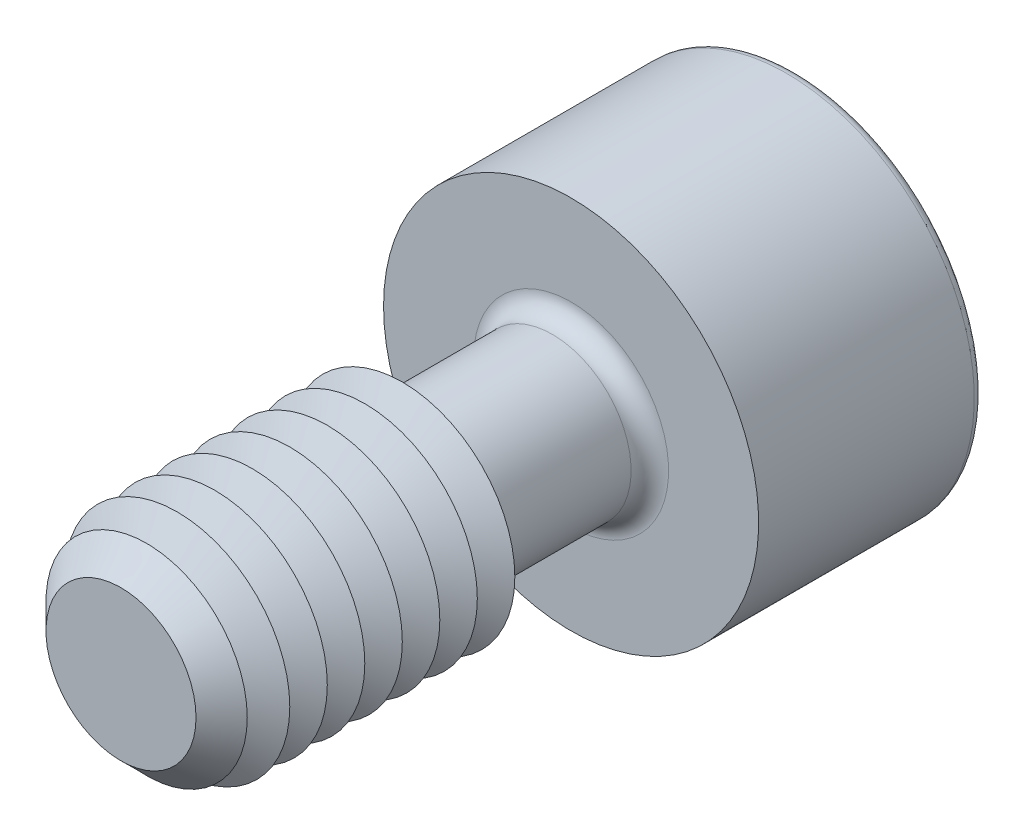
ISO-10303-21;
HEADER;
FILE_DESCRIPTION(('STEP AP214'),'2;1');
FILE_NAME('part.step','',(''),(''),'','','');
FILE_SCHEMA(('AUTOMOTIVE_DESIGN { 1 0 10303 214 1 1 1 1 }'));
ENDSEC;
DATA;
#1=APPLICATION_CONTEXT('core data for automotive mechanical design processes');
#2=APPLICATION_PROTOCOL_DEFINITION('international standard','automotive_design',2000,#1);
#3=PRODUCT_CONTEXT('',#1,'mechanical');
#4=PRODUCT('Part','Part','',(#3));
#5=PRODUCT_RELATED_PRODUCT_CATEGORY('part','',(#4));
#6=PRODUCT_DEFINITION_FORMATION('','',#4);
#7=PRODUCT_DEFINITION_CONTEXT('part definition',#1,'design');
#8=PRODUCT_DEFINITION('design','',#6,#7);
#9=PRODUCT_DEFINITION_SHAPE('','',#8);
#10=(LENGTH_UNIT() NAMED_UNIT(*) SI_UNIT(.MILLI.,.METRE.));
#11=(NAMED_UNIT(*) PLANE_ANGLE_UNIT() SI_UNIT($,.RADIAN.));
#12=(NAMED_UNIT(*) SI_UNIT($,.STERADIAN.) SOLID_ANGLE_UNIT());
#13=UNCERTAINTY_MEASURE_WITH_UNIT(LENGTH_MEASURE(1.E-05),#10,'distance_accuracy_value','');
#14=(GEOMETRIC_REPRESENTATION_CONTEXT(3) GLOBAL_UNCERTAINTY_ASSIGNED_CONTEXT((#13)) GLOBAL_UNIT_ASSIGNED_CONTEXT((#10,
#11,#12)) REPRESENTATION_CONTEXT('',''));
#15=CARTESIAN_POINT('',(0.,0.,0.));
#16=DIRECTION('',(0.,0.,1.));
#17=DIRECTION('',(1.,0.,0.));
#18=AXIS2_PLACEMENT_3D('',#15,#16,#17);
#19=CARTESIAN_POINT('',(-1.44337567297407,-2.5,-7.));
#20=DIRECTION('',(0.,0.,1.));
#21=DIRECTION('',(1.,0.,0.));
#22=AXIS2_PLACEMENT_3D('',#19,#20,#21);
#23=PLANE('',#22);
#24=DIRECTION('',(1.,0.,0.));
#25=VECTOR('',#24,1.);
#26=CARTESIAN_POINT('',(-1.44337567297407,-2.5,-7.));
#27=LINE('',#26,#25);
#28=CARTESIAN_POINT('',(0.,-2.5,-7.));
#29=VERTEX_POINT('',#28);
#30=CARTESIAN_POINT('',(1.44337567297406,-2.5,-7.));
#31=VERTEX_POINT('',#30);
#32=EDGE_CURVE('E729',#29,#31,#27,.T.);
#33=ORIENTED_EDGE('',*,*,#32,.F.);
#34=CARTESIAN_POINT('',(0.,0.,-7.));
#35=DIRECTION('',(0.,0.,1.));
#36=DIRECTION('',(0.,-1.,0.));
#37=AXIS2_PLACEMENT_3D('',#34,#35,#36);
#38=CIRCLE('',#37,2.5);
#39=CARTESIAN_POINT('',(2.1650635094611,-1.25,-7.));
#40=VERTEX_POINT('',#39);
#41=EDGE_CURVE('E53',#29,#40,#38,.T.);
#42=ORIENTED_EDGE('',*,*,#41,.T.);
#43=DIRECTION('',(0.5,0.866025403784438,0.));
#44=VECTOR('',#43,1.);
#45=CARTESIAN_POINT('',(1.44337567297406,-2.5,-7.));
#46=LINE('',#45,#44);
#47=EDGE_CURVE('E716',#31,#40,#46,.T.);
#48=ORIENTED_EDGE('',*,*,#47,.F.);
#49=EDGE_LOOP('',(#33,#42,#48));
#50=FACE_BOUND('',#49,.T.);
#51=ADVANCED_FACE('F41',(#50),#23,.F.);
#52=CARTESIAN_POINT('',(2.88675134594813,0.,-7.));
#53=VERTEX_POINT('',#52);
#54=EDGE_CURVE('E725',#40,#53,#46,.T.);
#55=ORIENTED_EDGE('',*,*,#54,.F.);
#56=CARTESIAN_POINT('',(2.1650635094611,1.25,-6.99999999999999));
#57=VERTEX_POINT('',#56);
#58=EDGE_CURVE('E11',#40,#57,#38,.T.);
#59=ORIENTED_EDGE('',*,*,#58,.T.);
#60=DIRECTION('',(-0.5,0.866025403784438,0.));
#61=VECTOR('',#60,1.);
#62=CARTESIAN_POINT('',(2.88675134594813,0.,-7.));
#63=LINE('',#62,#61);
#64=EDGE_CURVE('E715',#53,#57,#63,.T.);
#65=ORIENTED_EDGE('',*,*,#64,.F.);
#66=EDGE_LOOP('',(#55,#59,#65));
#67=FACE_BOUND('',#66,.T.);
#68=ADVANCED_FACE('F133',(#67),#23,.F.);
#69=CARTESIAN_POINT('',(1.44337567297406,2.5,-7.));
#70=VERTEX_POINT('',#69);
#71=EDGE_CURVE('E710',#57,#70,#63,.T.);
#72=ORIENTED_EDGE('',*,*,#71,.F.);
#73=CARTESIAN_POINT('',(0.,2.5,-6.99999999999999));
#74=VERTEX_POINT('',#73);
#75=EDGE_CURVE('E51',#57,#74,#38,.T.);
#76=ORIENTED_EDGE('',*,*,#75,.T.);
#77=DIRECTION('',(-1.,0.,0.));
#78=VECTOR('',#77,1.);
#79=CARTESIAN_POINT('',(1.44337567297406,2.5,-7.));
#80=LINE('',#79,#78);
#81=EDGE_CURVE('E177',#70,#74,#80,.T.);
#82=ORIENTED_EDGE('',*,*,#81,.F.);
#83=EDGE_LOOP('',(#72,#76,#82));
#84=FACE_BOUND('',#83,.T.);
#85=ADVANCED_FACE('F139',(#84),#23,.F.);
#86=CARTESIAN_POINT('',(-1.44337567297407,2.5,-7.));
#87=VERTEX_POINT('',#86);
#88=EDGE_CURVE('E720',#74,#87,#80,.T.);
#89=ORIENTED_EDGE('',*,*,#88,.F.);
#90=CARTESIAN_POINT('',(-2.1650635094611,1.25,-6.99999999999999));
#91=VERTEX_POINT('',#90);
#92=EDGE_CURVE('E263',#74,#91,#38,.T.);
#93=ORIENTED_EDGE('',*,*,#92,.T.);
#94=DIRECTION('',(-0.5,-0.866025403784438,0.));
#95=VECTOR('',#94,1.);
#96=CARTESIAN_POINT('',(-1.44337567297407,2.5,-7.));
#97=LINE('',#96,#95);
#98=EDGE_CURVE('E176',#87,#91,#97,.T.);
#99=ORIENTED_EDGE('',*,*,#98,.F.);
#100=EDGE_LOOP('',(#89,#93,#99));
#101=FACE_BOUND('',#100,.T.);
#102=ADVANCED_FACE('F157',(#101),#23,.F.);
#103=CARTESIAN_POINT('',(-2.88675134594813,0.,-7.));
#104=VERTEX_POINT('',#103);
#105=EDGE_CURVE('E170',#91,#104,#97,.T.);
#106=ORIENTED_EDGE('',*,*,#105,.F.);
#107=CARTESIAN_POINT('',(-2.1650635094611,-1.25,-7.));
#108=VERTEX_POINT('',#107);
#109=EDGE_CURVE('E172',#91,#108,#38,.T.);
#110=ORIENTED_EDGE('',*,*,#109,.T.);
#111=DIRECTION('',(0.5,-0.866025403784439,0.));
#112=VECTOR('',#111,1.);
#113=CARTESIAN_POINT('',(-2.88675134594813,0.,-7.));
#114=LINE('',#113,#112);
#115=EDGE_CURVE('E174',#104,#108,#114,.T.);
#116=ORIENTED_EDGE('',*,*,#115,.F.);
#117=EDGE_LOOP('',(#106,#110,#116));
#118=FACE_BOUND('',#117,.T.);
#119=ADVANCED_FACE('F146',(#118),#23,.F.);
#120=CARTESIAN_POINT('',(0.,0.,-12.));
#121=DIRECTION('',(0.,0.,-1.));
#122=DIRECTION('',(-1.,0.,0.));
#123=AXIS2_PLACEMENT_3D('',#120,#121,#122);
#124=PLANE('',#123);
#125=CARTESIAN_POINT('',(0.,0.,-12.));
#126=DIRECTION('',(0.,0.,-1.));
#127=DIRECTION('',(-1.,0.,0.));
#128=AXIS2_PLACEMENT_3D('',#125,#126,#127);
#129=CIRCLE('',#128,4.75);
#130=CARTESIAN_POINT('',(-4.75,0.,-12.));
#131=VERTEX_POINT('',#130);
#132=EDGE_CURVE('E251',#131,#131,#129,.T.);
#133=ORIENTED_EDGE('',*,*,#132,.T.);
#134=EDGE_LOOP('',(#133));
#135=FACE_BOUND('',#134,.T.);
#136=DIRECTION('',(-0.5,-0.866025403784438,0.));
#137=VECTOR('',#136,1.);
#138=CARTESIAN_POINT('',(-1.44337567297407,2.5,-12.));
#139=LINE('',#138,#137);
#140=CARTESIAN_POINT('',(-1.44337567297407,2.5,-12.));
#141=VERTEX_POINT('',#140);
#142=CARTESIAN_POINT('',(-2.88675134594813,0.,-12.));
#143=VERTEX_POINT('',#142);
#144=EDGE_CURVE('E212',#141,#143,#139,.T.);
#145=ORIENTED_EDGE('',*,*,#144,.T.);
#146=DIRECTION('',(0.5,-0.866025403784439,0.));
#147=VECTOR('',#146,1.);
#148=CARTESIAN_POINT('',(-2.88675134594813,0.,-12.));
#149=LINE('',#148,#147);
#150=CARTESIAN_POINT('',(-1.44337567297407,-2.5,-12.));
#151=VERTEX_POINT('',#150);
#152=EDGE_CURVE('E67',#143,#151,#149,.T.);
#153=ORIENTED_EDGE('',*,*,#152,.T.);
#154=DIRECTION('',(1.,0.,0.));
#155=VECTOR('',#154,1.);
#156=CARTESIAN_POINT('',(-1.44337567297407,-2.5,-12.));
#157=LINE('',#156,#155);
#158=CARTESIAN_POINT('',(1.44337567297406,-2.5,-12.));
#159=VERTEX_POINT('',#158);
#160=EDGE_CURVE('E196',#151,#159,#157,.T.);
#161=ORIENTED_EDGE('',*,*,#160,.T.);
#162=DIRECTION('',(0.5,0.866025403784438,0.));
#163=VECTOR('',#162,1.);
#164=CARTESIAN_POINT('',(1.44337567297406,-2.5,-12.));
#165=LINE('',#164,#163);
#166=CARTESIAN_POINT('',(2.88675134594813,0.,-12.));
#167=VERTEX_POINT('',#166);
#168=EDGE_CURVE('E200',#159,#167,#165,.T.);
#169=ORIENTED_EDGE('',*,*,#168,.T.);
#170=DIRECTION('',(-0.5,0.866025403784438,0.));
#171=VECTOR('',#170,1.);
#172=CARTESIAN_POINT('',(2.88675134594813,0.,-12.));
#173=LINE('',#172,#171);
#174=CARTESIAN_POINT('',(1.44337567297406,2.5,-12.));
#175=VERTEX_POINT('',#174);
#176=EDGE_CURVE('E204',#167,#175,#173,.T.);
#177=ORIENTED_EDGE('',*,*,#176,.T.);
#178=DIRECTION('',(-1.,0.,0.));
#179=VECTOR('',#178,1.);
#180=CARTESIAN_POINT('',(1.44337567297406,2.5,-12.));
#181=LINE('',#180,#179);
#182=EDGE_CURVE('E208',#175,#141,#181,.T.);
#183=ORIENTED_EDGE('',*,*,#182,.T.);
#184=EDGE_LOOP('',(#145,#153,#161,#169,#177,#183));
#185=FACE_BOUND('',#184,.T.);
#186=ADVANCED_FACE('F156',(#135,#185),#124,.T.);
#187=CARTESIAN_POINT('',(0.,0.,6.));
#188=DIRECTION('',(0.,0.,-1.));
#189=DIRECTION('',(-1.,0.,0.));
#190=AXIS2_PLACEMENT_3D('',#187,#188,#189);
#191=CYLINDRICAL_SURFACE('',#190,2.1);
#192=CARTESIAN_POINT('',(0.,0.,-5.5));
#193=DIRECTION('',(0.,0.,-1.));
#194=DIRECTION('',(-1.,0.,0.));
#195=AXIS2_PLACEMENT_3D('',#192,#193,#194);
#196=CIRCLE('',#195,2.1);
#197=CARTESIAN_POINT('',(-2.1,0.,-5.5));
#198=VERTEX_POINT('',#197);
#199=EDGE_CURVE('E247',#198,#198,#196,.F.);
#200=ORIENTED_EDGE('',*,*,#199,.T.);
#201=EDGE_LOOP('',(#200));
#202=FACE_BOUND('',#201,.T.);
#203=CARTESIAN_POINT('',(0.,0.,-2.01961524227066));
#204=DIRECTION('',(0.,0.,-1.));
#205=DIRECTION('',(0.,1.,0.));
#206=AXIS2_PLACEMENT_3D('',#203,#204,#205);
#207=CIRCLE('',#206,2.1);
#208=CARTESIAN_POINT('',(0.,2.1,-2.01961524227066));
#209=VERTEX_POINT('',#208);
#210=EDGE_CURVE('E235',#209,#209,#207,.T.);
#211=ORIENTED_EDGE('',*,*,#210,.T.);
#212=EDGE_LOOP('',(#211));
#213=FACE_BOUND('',#212,.T.);
#214=ADVANCED_FACE('F163',(#202,#213),#191,.T.);
#215=CARTESIAN_POINT('',(0.,0.,-2.01961524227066));
#216=DIRECTION('',(0.,0.,1.));
#217=DIRECTION('',(0.,-1.,0.));
#218=AXIS2_PLACEMENT_3D('',#215,#216,#217);
#219=CONICAL_SURFACE('',#218,2.1,1.0471975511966);
#220=CARTESIAN_POINT('',(0.,0.,-1.5));
#221=DIRECTION('',(0.,0.,-1.));
#222=DIRECTION('',(-1.,0.,0.));
#223=AXIS2_PLACEMENT_3D('',#220,#221,#222);
#224=CIRCLE('',#223,3.);
#225=CARTESIAN_POINT('',(-3.,0.,-1.5));
#226=VERTEX_POINT('',#225);
#227=EDGE_CURVE('E267',#226,#226,#224,.T.);
#228=ORIENTED_EDGE('',*,*,#227,.T.);
#229=EDGE_LOOP('',(#228));
#230=FACE_BOUND('',#229,.T.);
#231=ORIENTED_EDGE('',*,*,#210,.F.);
#232=EDGE_LOOP('',(#231));
#233=FACE_BOUND('',#232,.T.);
#234=ADVANCED_FACE('F487',(#230,#233),#219,.T.);
#235=CARTESIAN_POINT('',(0.,0.,-6.));
#236=DIRECTION('',(0.,0.,-1.));
#237=DIRECTION('',(-1.,0.,0.));
#238=AXIS2_PLACEMENT_3D('',#235,#236,#237);
#239=PLANE('',#238);
#240=CARTESIAN_POINT('',(0.,0.,-6.));
#241=DIRECTION('',(0.,0.,-1.));
#242=DIRECTION('',(-1.,0.,0.));
#243=AXIS2_PLACEMENT_3D('',#240,#241,#242);
#244=CIRCLE('',#243,2.6);
#245=CARTESIAN_POINT('',(-2.6,0.,-6.));
#246=VERTEX_POINT('',#245);
#247=EDGE_CURVE('E243',#246,#246,#244,.T.);
#248=ORIENTED_EDGE('',*,*,#247,.T.);
#249=EDGE_LOOP('',(#248));
#250=FACE_BOUND('',#249,.T.);
#251=CARTESIAN_POINT('',(0.,0.,-6.));
#252=DIRECTION('',(0.,0.,-1.));
#253=DIRECTION('',(-1.,0.,0.));
#254=AXIS2_PLACEMENT_3D('',#251,#252,#253);
#255=CIRCLE('',#254,5.);
#256=CARTESIAN_POINT('',(-5.,0.,-6.));
#257=VERTEX_POINT('',#256);
#258=EDGE_CURVE('E231',#257,#257,#255,.T.);
#259=ORIENTED_EDGE('',*,*,#258,.F.);
#260=EDGE_LOOP('',(#259));
#261=FACE_BOUND('',#260,.T.);
#262=ADVANCED_FACE('F480',(#250,#261),#239,.F.);
#263=CARTESIAN_POINT('',(0.,0.,-12.));
#264=DIRECTION('',(0.,0.,1.));
#265=DIRECTION('',(1.,0.,0.));
#266=AXIS2_PLACEMENT_3D('',#263,#264,#265);
#267=CYLINDRICAL_SURFACE('',#266,5.);
#268=CARTESIAN_POINT('',(0.,0.,-11.75));
#269=DIRECTION('',(0.,0.,-1.));
#270=DIRECTION('',(-1.,0.,0.));
#271=AXIS2_PLACEMENT_3D('',#268,#269,#270);
#272=CIRCLE('',#271,5.);
#273=CARTESIAN_POINT('',(-5.,0.,-11.75));
#274=VERTEX_POINT('',#273);
#275=EDGE_CURVE('E254',#274,#274,#272,.F.);
#276=ORIENTED_EDGE('',*,*,#275,.T.);
#277=EDGE_LOOP('',(#276));
#278=FACE_BOUND('',#277,.T.);
#279=ORIENTED_EDGE('',*,*,#258,.T.);
#280=EDGE_LOOP('',(#279));
#281=FACE_BOUND('',#280,.T.);
#282=ADVANCED_FACE('F486',(#278,#281),#267,.T.);
#283=CARTESIAN_POINT('',(-2.88675134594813,0.,-7.));
#284=DIRECTION('',(0.866025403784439,0.5,0.));
#285=DIRECTION('',(-0.5,0.866025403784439,0.));
#286=AXIS2_PLACEMENT_3D('',#283,#284,#285);
#287=PLANE('',#286);
#288=ORIENTED_EDGE('',*,*,#152,.F.);
#289=DIRECTION('',(0.,0.,-1.));
#290=VECTOR('',#289,1.);
#291=CARTESIAN_POINT('',(-2.88675134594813,0.,-7.));
#292=LINE('',#291,#290);
#293=EDGE_CURVE('E186',#104,#143,#292,.T.);
#294=ORIENTED_EDGE('',*,*,#293,.F.);
#295=ORIENTED_EDGE('',*,*,#115,.T.);
#296=CARTESIAN_POINT('',(-1.44337567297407,-2.5,-7.));
#297=VERTEX_POINT('',#296);
#298=EDGE_CURVE('E215',#108,#297,#114,.T.);
#299=ORIENTED_EDGE('',*,*,#298,.T.);
#300=DIRECTION('',(0.,0.,-1.));
#301=VECTOR('',#300,1.);
#302=CARTESIAN_POINT('',(-1.44337567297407,-2.5,-7.));
#303=LINE('',#302,#301);
#304=EDGE_CURVE('E228',#297,#151,#303,.T.);
#305=ORIENTED_EDGE('',*,*,#304,.T.);
#306=EDGE_LOOP('',(#288,#294,#295,#299,#305));
#307=FACE_BOUND('',#306,.T.);
#308=ADVANCED_FACE('F498',(#307),#287,.T.);
#309=CARTESIAN_POINT('',(-1.44337567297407,-2.5,-7.));
#310=DIRECTION('',(0.,1.,0.));
#311=DIRECTION('',(-1.,0.,0.));
#312=AXIS2_PLACEMENT_3D('',#309,#310,#311);
#313=PLANE('',#312);
#314=ORIENTED_EDGE('',*,*,#160,.F.);
#315=ORIENTED_EDGE('',*,*,#304,.F.);
#316=EDGE_CURVE('E726',#297,#29,#27,.T.);
#317=ORIENTED_EDGE('',*,*,#316,.T.);
#318=ORIENTED_EDGE('',*,*,#32,.T.);
#319=DIRECTION('',(0.,0.,-1.));
#320=VECTOR('',#319,1.);
#321=CARTESIAN_POINT('',(1.44337567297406,-2.5,-7.));
#322=LINE('',#321,#320);
#323=EDGE_CURVE('E225',#31,#159,#322,.T.);
#324=ORIENTED_EDGE('',*,*,#323,.T.);
#325=EDGE_LOOP('',(#314,#315,#317,#318,#324));
#326=FACE_BOUND('',#325,.T.);
#327=ADVANCED_FACE('F514',(#326),#313,.T.);
#328=CARTESIAN_POINT('',(1.44337567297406,-2.5,-7.));
#329=DIRECTION('',(-0.866025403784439,0.5,0.));
#330=DIRECTION('',(-0.5,-0.866025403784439,0.));
#331=AXIS2_PLACEMENT_3D('',#328,#329,#330);
#332=PLANE('',#331);
#333=ORIENTED_EDGE('',*,*,#168,.F.);
#334=ORIENTED_EDGE('',*,*,#323,.F.);
#335=ORIENTED_EDGE('',*,*,#47,.T.);
#336=ORIENTED_EDGE('',*,*,#54,.T.);
#337=DIRECTION('',(0.,0.,-1.));
#338=VECTOR('',#337,1.);
#339=CARTESIAN_POINT('',(2.88675134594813,0.,-7.));
#340=LINE('',#339,#338);
#341=EDGE_CURVE('E222',#53,#167,#340,.T.);
#342=ORIENTED_EDGE('',*,*,#341,.T.);
#343=EDGE_LOOP('',(#333,#334,#335,#336,#342));
#344=FACE_BOUND('',#343,.T.);
#345=ADVANCED_FACE('F524',(#344),#332,.T.);
#346=CARTESIAN_POINT('',(2.88675134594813,0.,-7.));
#347=DIRECTION('',(-0.866025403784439,-0.5,0.));
#348=DIRECTION('',(0.5,-0.866025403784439,0.));
#349=AXIS2_PLACEMENT_3D('',#346,#347,#348);
#350=PLANE('',#349);
#351=ORIENTED_EDGE('',*,*,#176,.F.);
#352=ORIENTED_EDGE('',*,*,#341,.F.);
#353=ORIENTED_EDGE('',*,*,#64,.T.);
#354=ORIENTED_EDGE('',*,*,#71,.T.);
#355=DIRECTION('',(0.,0.,-1.));
#356=VECTOR('',#355,1.);
#357=CARTESIAN_POINT('',(1.44337567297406,2.5,-7.));
#358=LINE('',#357,#356);
#359=EDGE_CURVE('E219',#70,#175,#358,.T.);
#360=ORIENTED_EDGE('',*,*,#359,.T.);
#361=EDGE_LOOP('',(#351,#352,#353,#354,#360));
#362=FACE_BOUND('',#361,.T.);
#363=ADVANCED_FACE('F534',(#362),#350,.T.);
#364=CARTESIAN_POINT('',(1.44337567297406,2.5,-7.));
#365=DIRECTION('',(0.,-1.,0.));
#366=DIRECTION('',(0.,0.,-1.));
#367=AXIS2_PLACEMENT_3D('',#364,#365,#366);
#368=PLANE('',#367);
#369=ORIENTED_EDGE('',*,*,#182,.F.);
#370=ORIENTED_EDGE('',*,*,#359,.F.);
#371=ORIENTED_EDGE('',*,*,#81,.T.);
#372=ORIENTED_EDGE('',*,*,#88,.T.);
#373=DIRECTION('',(0.,0.,-1.));
#374=VECTOR('',#373,1.);
#375=CARTESIAN_POINT('',(-1.44337567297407,2.5,-7.));
#376=LINE('',#375,#374);
#377=EDGE_CURVE('E182',#87,#141,#376,.T.);
#378=ORIENTED_EDGE('',*,*,#377,.T.);
#379=EDGE_LOOP('',(#369,#370,#371,#372,#378));
#380=FACE_BOUND('',#379,.T.);
#381=ADVANCED_FACE('F152',(#380),#368,.T.);
#382=CARTESIAN_POINT('',(-1.44337567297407,2.5,-7.));
#383=DIRECTION('',(0.866025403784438,-0.5,0.));
#384=DIRECTION('',(0.5,0.866025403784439,0.));
#385=AXIS2_PLACEMENT_3D('',#382,#383,#384);
#386=PLANE('',#385);
#387=ORIENTED_EDGE('',*,*,#144,.F.);
#388=ORIENTED_EDGE('',*,*,#377,.F.);
#389=ORIENTED_EDGE('',*,*,#98,.T.);
#390=ORIENTED_EDGE('',*,*,#105,.T.);
#391=ORIENTED_EDGE('',*,*,#293,.T.);
#392=EDGE_LOOP('',(#387,#388,#389,#390,#391));
#393=FACE_BOUND('',#392,.T.);
#394=ADVANCED_FACE('F144',(#393),#386,.T.);
#395=ORIENTED_EDGE('',*,*,#298,.F.);
#396=EDGE_CURVE('E257',#108,#29,#38,.T.);
#397=ORIENTED_EDGE('',*,*,#396,.T.);
#398=ORIENTED_EDGE('',*,*,#316,.F.);
#399=EDGE_LOOP('',(#395,#397,#398));
#400=FACE_BOUND('',#399,.T.);
#401=ADVANCED_FACE('F135',(#400),#23,.F.);
#402=CARTESIAN_POINT('',(0.,0.,-5.5));
#403=DIRECTION('',(0.,0.,-1.));
#404=DIRECTION('',(-1.,0.,0.));
#405=AXIS2_PLACEMENT_3D('',#402,#403,#404);
#406=TOROIDAL_SURFACE('',#405,2.6,0.5);
#407=ORIENTED_EDGE('',*,*,#199,.F.);
#408=EDGE_LOOP('',(#407));
#409=FACE_BOUND('',#408,.T.);
#410=ORIENTED_EDGE('',*,*,#247,.F.);
#411=EDGE_LOOP('',(#410));
#412=FACE_BOUND('',#411,.T.);
#413=ADVANCED_FACE('F129',(#409,#412),#406,.F.);
#414=CARTESIAN_POINT('',(0.,0.,-11.75));
#415=DIRECTION('',(0.,0.,-1.));
#416=DIRECTION('',(-1.,0.,0.));
#417=AXIS2_PLACEMENT_3D('',#414,#415,#416);
#418=TOROIDAL_SURFACE('',#417,4.75,0.25);
#419=ORIENTED_EDGE('',*,*,#275,.F.);
#420=EDGE_LOOP('',(#419));
#421=FACE_BOUND('',#420,.T.);
#422=ORIENTED_EDGE('',*,*,#132,.F.);
#423=EDGE_LOOP('',(#422));
#424=FACE_BOUND('',#423,.T.);
#425=ADVANCED_FACE('F43',(#421,#424),#418,.T.);
#426=CARTESIAN_POINT('',(0.,0.,-5.55662432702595));
#427=DIRECTION('',(0.,0.,-1.));
#428=DIRECTION('',(0.,1.,0.));
#429=AXIS2_PLACEMENT_3D('',#426,#427,#428);
#430=CONICAL_SURFACE('',#429,0.,1.0471975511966);
#431=ORIENTED_EDGE('',*,*,#41,.F.);
#432=ORIENTED_EDGE('',*,*,#396,.F.);
#433=ORIENTED_EDGE('',*,*,#109,.F.);
#434=ORIENTED_EDGE('',*,*,#92,.F.);
#435=ORIENTED_EDGE('',*,*,#75,.F.);
#436=ORIENTED_EDGE('',*,*,#58,.F.);
#437=EDGE_LOOP('',(#431,#432,#433,#434,#435,#436));
#438=FACE_BOUND('',#437,.T.);
#439=CARTESIAN_POINT('',(0.,0.,-5.55662432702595));
#440=VERTEX_POINT('',#439);
#441=VERTEX_LOOP('',#440);
#442=FACE_BOUND('',#441,.T.);
#443=ADVANCED_FACE('F118',(#438,#442),#430,.F.);
#444=CARTESIAN_POINT('',(0.,0.,-1.));
#445=DIRECTION('',(0.,0.,-1.));
#446=DIRECTION('',(-1.,0.,0.));
#447=AXIS2_PLACEMENT_3D('',#444,#445,#446);
#448=CONICAL_SURFACE('',#447,2.13397459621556,1.0471975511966);
#449=ORIENTED_EDGE('',*,*,#227,.F.);
#450=EDGE_LOOP('',(#449));
#451=FACE_BOUND('',#450,.T.);
#452=CARTESIAN_POINT('',(0.,0.,-1.));
#453=DIRECTION('',(0.,0.,-1.));
#454=DIRECTION('',(-1.,0.,0.));
#455=AXIS2_PLACEMENT_3D('',#452,#453,#454);
#456=CIRCLE('',#455,2.13397459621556);
#457=CARTESIAN_POINT('',(-2.13397459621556,0.,-1.));
#458=VERTEX_POINT('',#457);
#459=EDGE_CURVE('E273',#458,#458,#456,.T.);
#460=ORIENTED_EDGE('',*,*,#459,.T.);
#461=EDGE_LOOP('',(#460));
#462=FACE_BOUND('',#461,.T.);
#463=ADVANCED_FACE('F120',(#451,#462),#448,.T.);
#464=CARTESIAN_POINT('',(0.,0.,-0.5));
#465=DIRECTION('',(0.,0.,1.));
#466=DIRECTION('',(1.,0.,0.));
#467=AXIS2_PLACEMENT_3D('',#464,#465,#466);
#468=CONICAL_SURFACE('',#467,3.,1.0471975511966);
#469=ORIENTED_EDGE('',*,*,#459,.F.);
#470=EDGE_LOOP('',(#469));
#471=FACE_BOUND('',#470,.T.);
#472=CARTESIAN_POINT('',(0.,0.,-0.500000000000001));
#473=DIRECTION('',(0.,0.,-1.));
#474=DIRECTION('',(-1.,0.,0.));
#475=AXIS2_PLACEMENT_3D('',#472,#473,#474);
#476=CIRCLE('',#475,3.);
#477=CARTESIAN_POINT('',(-3.,0.,-0.500000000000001));
#478=VERTEX_POINT('',#477);
#479=EDGE_CURVE('E279',#478,#478,#476,.T.);
#480=ORIENTED_EDGE('',*,*,#479,.T.);
#481=EDGE_LOOP('',(#480));
#482=FACE_BOUND('',#481,.T.);
#483=ADVANCED_FACE('F126',(#471,#482),#468,.T.);
#484=CARTESIAN_POINT('',(0.,0.,0.));
#485=DIRECTION('',(0.,0.,-1.));
#486=DIRECTION('',(-1.,0.,0.));
#487=AXIS2_PLACEMENT_3D('',#484,#485,#486);
#488=CONICAL_SURFACE('',#487,2.13397459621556,1.0471975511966);
#489=ORIENTED_EDGE('',*,*,#479,.F.);
#490=EDGE_LOOP('',(#489));
#491=FACE_BOUND('',#490,.T.);
#492=CARTESIAN_POINT('',(0.,0.,0.));
#493=DIRECTION('',(0.,0.,-1.));
#494=DIRECTION('',(-1.,0.,0.));
#495=AXIS2_PLACEMENT_3D('',#492,#493,#494);
#496=CIRCLE('',#495,2.13397459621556);
#497=CARTESIAN_POINT('',(-2.13397459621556,0.,0.));
#498=VERTEX_POINT('',#497);
#499=EDGE_CURVE('E285',#498,#498,#496,.T.);
#500=ORIENTED_EDGE('',*,*,#499,.T.);
#501=EDGE_LOOP('',(#500));
#502=FACE_BOUND('',#501,.T.);
#503=ADVANCED_FACE('F384',(#491,#502),#488,.T.);
#504=CARTESIAN_POINT('',(0.,0.,0.5));
#505=DIRECTION('',(0.,0.,1.));
#506=DIRECTION('',(1.,0.,0.));
#507=AXIS2_PLACEMENT_3D('',#504,#505,#506);
#508=CONICAL_SURFACE('',#507,3.,1.0471975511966);
#509=ORIENTED_EDGE('',*,*,#499,.F.);
#510=EDGE_LOOP('',(#509));
#511=FACE_BOUND('',#510,.T.);
#512=CARTESIAN_POINT('',(0.,0.,0.499999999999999));
#513=DIRECTION('',(0.,0.,-1.));
#514=DIRECTION('',(-1.,0.,0.));
#515=AXIS2_PLACEMENT_3D('',#512,#513,#514);
#516=CIRCLE('',#515,3.);
#517=CARTESIAN_POINT('',(-3.,0.,0.499999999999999));
#518=VERTEX_POINT('',#517);
#519=EDGE_CURVE('E289',#518,#518,#516,.T.);
#520=ORIENTED_EDGE('',*,*,#519,.T.);
#521=EDGE_LOOP('',(#520));
#522=FACE_BOUND('',#521,.T.);
#523=ADVANCED_FACE('F380',(#511,#522),#508,.T.);
#524=CARTESIAN_POINT('',(0.,0.,0.999999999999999));
#525=DIRECTION('',(0.,0.,-1.));
#526=DIRECTION('',(-1.,0.,0.));
#527=AXIS2_PLACEMENT_3D('',#524,#525,#526);
#528=CONICAL_SURFACE('',#527,2.13397459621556,1.0471975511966);
#529=ORIENTED_EDGE('',*,*,#519,.F.);
#530=EDGE_LOOP('',(#529));
#531=FACE_BOUND('',#530,.T.);
#532=CARTESIAN_POINT('',(0.,0.,0.999999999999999));
#533=DIRECTION('',(0.,0.,-1.));
#534=DIRECTION('',(-1.,0.,0.));
#535=AXIS2_PLACEMENT_3D('',#532,#533,#534);
#536=CIRCLE('',#535,2.13397459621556);
#537=CARTESIAN_POINT('',(-2.13397459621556,0.,0.999999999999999));
#538=VERTEX_POINT('',#537);
#539=EDGE_CURVE('E293',#538,#538,#536,.T.);
#540=ORIENTED_EDGE('',*,*,#539,.T.);
#541=EDGE_LOOP('',(#540));
#542=FACE_BOUND('',#541,.T.);
#543=ADVANCED_FACE('F376',(#531,#542),#528,.T.);
#544=CARTESIAN_POINT('',(0.,0.,1.5));
#545=DIRECTION('',(0.,0.,1.));
#546=DIRECTION('',(1.,0.,0.));
#547=AXIS2_PLACEMENT_3D('',#544,#545,#546);
#548=CONICAL_SURFACE('',#547,3.,1.0471975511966);
#549=ORIENTED_EDGE('',*,*,#539,.F.);
#550=EDGE_LOOP('',(#549));
#551=FACE_BOUND('',#550,.T.);
#552=CARTESIAN_POINT('',(0.,0.,1.5));
#553=DIRECTION('',(0.,0.,-1.));
#554=DIRECTION('',(-1.,0.,0.));
#555=AXIS2_PLACEMENT_3D('',#552,#553,#554);
#556=CIRCLE('',#555,3.);
#557=CARTESIAN_POINT('',(-3.,0.,1.5));
#558=VERTEX_POINT('',#557);
#559=EDGE_CURVE('E297',#558,#558,#556,.T.);
#560=ORIENTED_EDGE('',*,*,#559,.T.);
#561=EDGE_LOOP('',(#560));
#562=FACE_BOUND('',#561,.T.);
#563=ADVANCED_FACE('F372',(#551,#562),#548,.T.);
#564=CARTESIAN_POINT('',(0.,0.,2.));
#565=DIRECTION('',(0.,0.,-1.));
#566=DIRECTION('',(-1.,0.,0.));
#567=AXIS2_PLACEMENT_3D('',#564,#565,#566);
#568=CONICAL_SURFACE('',#567,2.13397459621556,1.0471975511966);
#569=ORIENTED_EDGE('',*,*,#559,.F.);
#570=EDGE_LOOP('',(#569));
#571=FACE_BOUND('',#570,.T.);
#572=CARTESIAN_POINT('',(0.,0.,2.));
#573=DIRECTION('',(0.,0.,-1.));
#574=DIRECTION('',(-1.,0.,0.));
#575=AXIS2_PLACEMENT_3D('',#572,#573,#574);
#576=CIRCLE('',#575,2.13397459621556);
#577=CARTESIAN_POINT('',(-2.13397459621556,0.,2.));
#578=VERTEX_POINT('',#577);
#579=EDGE_CURVE('E301',#578,#578,#576,.T.);
#580=ORIENTED_EDGE('',*,*,#579,.T.);
#581=EDGE_LOOP('',(#580));
#582=FACE_BOUND('',#581,.T.);
#583=ADVANCED_FACE('F368',(#571,#582),#568,.T.);
#584=CARTESIAN_POINT('',(0.,0.,2.5));
#585=DIRECTION('',(0.,0.,1.));
#586=DIRECTION('',(1.,0.,0.));
#587=AXIS2_PLACEMENT_3D('',#584,#585,#586);
#588=CONICAL_SURFACE('',#587,3.,1.0471975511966);
#589=ORIENTED_EDGE('',*,*,#579,.F.);
#590=EDGE_LOOP('',(#589));
#591=FACE_BOUND('',#590,.T.);
#592=CARTESIAN_POINT('',(0.,0.,2.5));
#593=DIRECTION('',(0.,0.,-1.));
#594=DIRECTION('',(-1.,0.,0.));
#595=AXIS2_PLACEMENT_3D('',#592,#593,#594);
#596=CIRCLE('',#595,3.);
#597=CARTESIAN_POINT('',(-3.,0.,2.5));
#598=VERTEX_POINT('',#597);
#599=EDGE_CURVE('E305',#598,#598,#596,.T.);
#600=ORIENTED_EDGE('',*,*,#599,.T.);
#601=EDGE_LOOP('',(#600));
#602=FACE_BOUND('',#601,.T.);
#603=ADVANCED_FACE('F364',(#591,#602),#588,.T.);
#604=CARTESIAN_POINT('',(0.,0.,3.));
#605=DIRECTION('',(0.,0.,-1.));
#606=DIRECTION('',(-1.,0.,0.));
#607=AXIS2_PLACEMENT_3D('',#604,#605,#606);
#608=CONICAL_SURFACE('',#607,2.13397459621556,1.0471975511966);
#609=ORIENTED_EDGE('',*,*,#599,.F.);
#610=EDGE_LOOP('',(#609));
#611=FACE_BOUND('',#610,.T.);
#612=CARTESIAN_POINT('',(0.,0.,3.));
#613=DIRECTION('',(0.,0.,-1.));
#614=DIRECTION('',(-1.,0.,0.));
#615=AXIS2_PLACEMENT_3D('',#612,#613,#614);
#616=CIRCLE('',#615,2.13397459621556);
#617=CARTESIAN_POINT('',(-2.13397459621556,0.,3.));
#618=VERTEX_POINT('',#617);
#619=EDGE_CURVE('E309',#618,#618,#616,.T.);
#620=ORIENTED_EDGE('',*,*,#619,.T.);
#621=EDGE_LOOP('',(#620));
#622=FACE_BOUND('',#621,.T.);
#623=ADVANCED_FACE('F360',(#611,#622),#608,.T.);
#624=CARTESIAN_POINT('',(0.,0.,3.5));
#625=DIRECTION('',(0.,0.,1.));
#626=DIRECTION('',(1.,0.,0.));
#627=AXIS2_PLACEMENT_3D('',#624,#625,#626);
#628=CONICAL_SURFACE('',#627,3.,1.0471975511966);
#629=ORIENTED_EDGE('',*,*,#619,.F.);
#630=EDGE_LOOP('',(#629));
#631=FACE_BOUND('',#630,.T.);
#632=CARTESIAN_POINT('',(0.,0.,3.5));
#633=DIRECTION('',(0.,0.,-1.));
#634=DIRECTION('',(-1.,0.,0.));
#635=AXIS2_PLACEMENT_3D('',#632,#633,#634);
#636=CIRCLE('',#635,3.);
#637=CARTESIAN_POINT('',(-3.,0.,3.5));
#638=VERTEX_POINT('',#637);
#639=EDGE_CURVE('E313',#638,#638,#636,.T.);
#640=ORIENTED_EDGE('',*,*,#639,.T.);
#641=EDGE_LOOP('',(#640));
#642=FACE_BOUND('',#641,.T.);
#643=ADVANCED_FACE('F356',(#631,#642),#628,.T.);
#644=CARTESIAN_POINT('',(0.,0.,4.));
#645=DIRECTION('',(0.,0.,-1.));
#646=DIRECTION('',(-1.,0.,0.));
#647=AXIS2_PLACEMENT_3D('',#644,#645,#646);
#648=CONICAL_SURFACE('',#647,2.13397459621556,1.0471975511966);
#649=ORIENTED_EDGE('',*,*,#639,.F.);
#650=EDGE_LOOP('',(#649));
#651=FACE_BOUND('',#650,.T.);
#652=CARTESIAN_POINT('',(0.,0.,4.));
#653=DIRECTION('',(0.,0.,-1.));
#654=DIRECTION('',(-1.,0.,0.));
#655=AXIS2_PLACEMENT_3D('',#652,#653,#654);
#656=CIRCLE('',#655,2.13397459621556);
#657=CARTESIAN_POINT('',(-2.13397459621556,0.,4.));
#658=VERTEX_POINT('',#657);
#659=EDGE_CURVE('E317',#658,#658,#656,.T.);
#660=ORIENTED_EDGE('',*,*,#659,.T.);
#661=EDGE_LOOP('',(#660));
#662=FACE_BOUND('',#661,.T.);
#663=ADVANCED_FACE('F352',(#651,#662),#648,.T.);
#664=CARTESIAN_POINT('',(0.,0.,4.5));
#665=DIRECTION('',(0.,0.,1.));
#666=DIRECTION('',(1.,0.,0.));
#667=AXIS2_PLACEMENT_3D('',#664,#665,#666);
#668=CONICAL_SURFACE('',#667,3.,1.0471975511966);
#669=ORIENTED_EDGE('',*,*,#659,.F.);
#670=EDGE_LOOP('',(#669));
#671=FACE_BOUND('',#670,.T.);
#672=CARTESIAN_POINT('',(0.,0.,4.5));
#673=DIRECTION('',(0.,0.,-1.));
#674=DIRECTION('',(-1.,0.,0.));
#675=AXIS2_PLACEMENT_3D('',#672,#673,#674);
#676=CIRCLE('',#675,3.);
#677=CARTESIAN_POINT('',(-3.,0.,4.5));
#678=VERTEX_POINT('',#677);
#679=EDGE_CURVE('E321',#678,#678,#676,.T.);
#680=ORIENTED_EDGE('',*,*,#679,.T.);
#681=EDGE_LOOP('',(#680));
#682=FACE_BOUND('',#681,.T.);
#683=ADVANCED_FACE('F345',(#671,#682),#668,.T.);
#684=CARTESIAN_POINT('',(0.,0.,5.));
#685=DIRECTION('',(0.,0.,-1.));
#686=DIRECTION('',(-1.,0.,0.));
#687=AXIS2_PLACEMENT_3D('',#684,#685,#686);
#688=CONICAL_SURFACE('',#687,2.13397459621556,1.0471975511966);
#689=ORIENTED_EDGE('',*,*,#679,.F.);
#690=EDGE_LOOP('',(#689));
#691=FACE_BOUND('',#690,.T.);
#692=CARTESIAN_POINT('',(0.,0.,5.));
#693=DIRECTION('',(0.,0.,-1.));
#694=DIRECTION('',(-1.,0.,0.));
#695=AXIS2_PLACEMENT_3D('',#692,#693,#694);
#696=CIRCLE('',#695,2.13397459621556);
#697=CARTESIAN_POINT('',(-2.13397459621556,0.,5.));
#698=VERTEX_POINT('',#697);
#699=EDGE_CURVE('E325',#698,#698,#696,.T.);
#700=ORIENTED_EDGE('',*,*,#699,.T.);
#701=EDGE_LOOP('',(#700));
#702=FACE_BOUND('',#701,.T.);
#703=ADVANCED_FACE('F331',(#691,#702),#688,.T.);
#704=CARTESIAN_POINT('',(0.,0.,5.5));
#705=DIRECTION('',(0.,0.,1.));
#706=DIRECTION('',(1.,0.,0.));
#707=AXIS2_PLACEMENT_3D('',#704,#705,#706);
#708=CONICAL_SURFACE('',#707,3.,1.0471975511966);
#709=CARTESIAN_POINT('',(0.,0.,5.31698729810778));
#710=DIRECTION('',(0.,0.,1.));
#711=DIRECTION('',(1.,0.,0.));
#712=AXIS2_PLACEMENT_3D('',#709,#710,#711);
#713=CIRCLE('',#712,2.68301270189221);
#714=CARTESIAN_POINT('',(2.68301270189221,0.,5.31698729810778));
#715=VERTEX_POINT('',#714);
#716=EDGE_CURVE('E45',#715,#715,#713,.F.);
#717=ORIENTED_EDGE('',*,*,#716,.T.);
#718=EDGE_LOOP('',(#717));
#719=FACE_BOUND('',#718,.T.);
#720=ORIENTED_EDGE('',*,*,#699,.F.);
#721=EDGE_LOOP('',(#720));
#722=FACE_BOUND('',#721,.T.);
#723=ADVANCED_FACE('F333',(#719,#722),#708,.T.);
#724=CARTESIAN_POINT('',(0.,0.,6.));
#725=DIRECTION('',(0.,0.,1.));
#726=DIRECTION('',(1.,0.,0.));
#727=AXIS2_PLACEMENT_3D('',#724,#725,#726);
#728=PLANE('',#727);
#729=CARTESIAN_POINT('',(0.,0.,6.));
#730=DIRECTION('',(0.,0.,1.));
#731=DIRECTION('',(1.,0.,0.));
#732=AXIS2_PLACEMENT_3D('',#729,#730,#731);
#733=CIRCLE('',#732,1.99999999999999);
#734=CARTESIAN_POINT('',(1.99999999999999,0.,6.));
#735=VERTEX_POINT('',#734);
#736=EDGE_CURVE('E239',#735,#735,#733,.T.);
#737=ORIENTED_EDGE('',*,*,#736,.T.);
#738=EDGE_LOOP('',(#737));
#739=FACE_BOUND('',#738,.T.);
#740=ADVANCED_FACE('F335',(#739),#728,.T.);
#741=CARTESIAN_POINT('',(0.,0.,5.));
#742=DIRECTION('',(0.,0.,-1.));
#743=DIRECTION('',(0.,1.,0.));
#744=AXIS2_PLACEMENT_3D('',#741,#742,#743);
#745=CONICAL_SURFACE('',#744,3.,0.785398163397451);
#746=ORIENTED_EDGE('',*,*,#716,.F.);
#747=EDGE_LOOP('',(#746));
#748=FACE_BOUND('',#747,.T.);
#749=ORIENTED_EDGE('',*,*,#736,.F.);
#750=EDGE_LOOP('',(#749));
#751=FACE_BOUND('',#750,.T.);
#752=ADVANCED_FACE('F342',(#748,#751),#745,.T.);
#753=CLOSED_SHELL('',(#51,#68,#85,#102,#119,#186,#214,#234,#262,#282,#308,#327,#345,#363,#381,
#394,#401,#413,#425,#443,#463,#483,#503,#523,#543,#563,#583,#603,#623,#643,#663,#683,#703,#723,
#740,#752));
#754=MANIFOLD_SOLID_BREP('B2',#753);
#755=ADVANCED_BREP_SHAPE_REPRESENTATION('',(#18,#754),#14);
#756=SHAPE_DEFINITION_REPRESENTATION(#9,#755);
ENDSEC;
END-ISO-10303-21;
